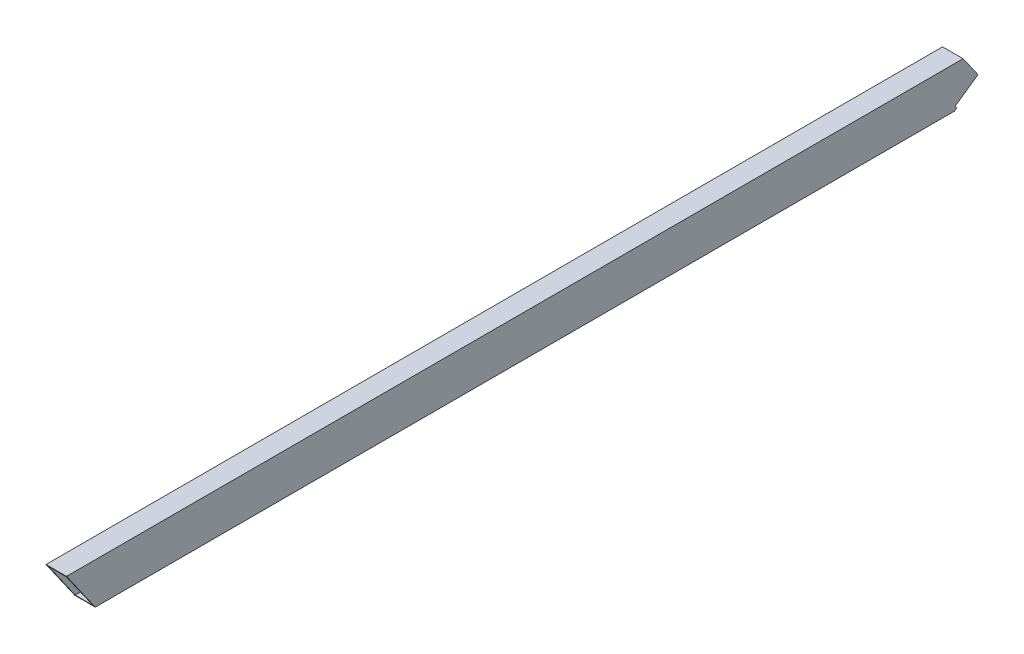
ISO-10303-21;
HEADER;
FILE_DESCRIPTION(('STEP AP214'),'2;1');
FILE_NAME('part.step','',(''),(''),'','','');
FILE_SCHEMA(('AUTOMOTIVE_DESIGN { 1 0 10303 214 1 1 1 1 }'));
ENDSEC;
DATA;
#1=APPLICATION_CONTEXT('core data for automotive mechanical design processes');
#2=APPLICATION_PROTOCOL_DEFINITION('international standard','automotive_design',2000,#1);
#3=PRODUCT_CONTEXT('',#1,'mechanical');
#4=PRODUCT('Part','Part','',(#3));
#5=PRODUCT_RELATED_PRODUCT_CATEGORY('part','',(#4));
#6=PRODUCT_DEFINITION_FORMATION('','',#4);
#7=PRODUCT_DEFINITION_CONTEXT('part definition',#1,'design');
#8=PRODUCT_DEFINITION('design','',#6,#7);
#9=PRODUCT_DEFINITION_SHAPE('','',#8);
#10=(LENGTH_UNIT() NAMED_UNIT(*) SI_UNIT(.MILLI.,.METRE.));
#11=(NAMED_UNIT(*) PLANE_ANGLE_UNIT() SI_UNIT($,.RADIAN.));
#12=(NAMED_UNIT(*) SI_UNIT($,.STERADIAN.) SOLID_ANGLE_UNIT());
#13=UNCERTAINTY_MEASURE_WITH_UNIT(LENGTH_MEASURE(1.E-05),#10,'distance_accuracy_value','');
#14=(GEOMETRIC_REPRESENTATION_CONTEXT(3) GLOBAL_UNCERTAINTY_ASSIGNED_CONTEXT((#13)) GLOBAL_UNIT_ASSIGNED_CONTEXT((#10,
#11,#12)) REPRESENTATION_CONTEXT('',''));
#15=CARTESIAN_POINT('',(0.,0.,0.));
#16=DIRECTION('',(0.,0.,1.));
#17=DIRECTION('',(1.,0.,0.));
#18=AXIS2_PLACEMENT_3D('',#15,#16,#17);
#19=CARTESIAN_POINT('',(-102.0000001,56.035463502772,-85.2820429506));
#20=DIRECTION('',(0.,0.819231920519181,0.573462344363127));
#21=DIRECTION('',(1.,0.,0.));
#22=AXIS2_PLACEMENT_3D('',#19,#20,#21);
#23=PLANE('',#22);
#24=DIRECTION('',(-1.,0.,0.));
#25=VECTOR('',#24,1.);
#26=CARTESIAN_POINT('',(-51.00000005,-2.457695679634,-1.720386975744));
#27=LINE('',#26,#25);
#28=CARTESIAN_POINT('',(-32.5,-2.457695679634,-1.720386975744));
#29=VERTEX_POINT('',#28);
#30=CARTESIAN_POINT('',(-37.5,-2.457695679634,-1.720386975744));
#31=VERTEX_POINT('',#30);
#32=EDGE_CURVE('E19',#29,#31,#27,.T.);
#33=ORIENTED_EDGE('',*,*,#32,.F.);
#34=DIRECTION('',(0.,-0.573462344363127,0.819231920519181));
#35=VECTOR('',#34,1.);
#36=CARTESIAN_POINT('',(-32.5,54.741904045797,-83.43410086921));
#37=LINE('',#36,#35);
#38=CARTESIAN_POINT('',(-32.5,-60.95085486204,81.841268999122));
#39=VERTEX_POINT('',#38);
#40=EDGE_CURVE('E223',#29,#39,#37,.T.);
#41=ORIENTED_EDGE('',*,*,#40,.T.);
#42=DIRECTION('',(1.,0.,0.));
#43=VECTOR('',#42,1.);
#44=CARTESIAN_POINT('',(-102.0000001,-60.95085486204,81.841268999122));
#45=LINE('',#44,#43);
#46=CARTESIAN_POINT('',(-37.5,-60.95085486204,81.841268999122));
#47=VERTEX_POINT('',#46);
#48=EDGE_CURVE('E277',#47,#39,#45,.T.);
#49=ORIENTED_EDGE('',*,*,#48,.F.);
#50=DIRECTION('',(0.,-0.573462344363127,0.819231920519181));
#51=VECTOR('',#50,1.);
#52=CARTESIAN_POINT('',(-37.5,55.564051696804,-84.60859751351));
#53=LINE('',#52,#51);
#54=EDGE_CURVE('E261',#31,#47,#53,.T.);
#55=ORIENTED_EDGE('',*,*,#54,.F.);
#56=EDGE_LOOP('',(#33,#41,#49,#55));
#57=FACE_BOUND('',#56,.T.);
#58=ADVANCED_FACE('F16',(#57),#23,.F.);
#59=CARTESIAN_POINT('',(32.5,70.,-70.));
#60=DIRECTION('',(0.,-1.,0.));
#61=DIRECTION('',(0.,0.,-1.));
#62=AXIS2_PLACEMENT_3D('',#59,#60,#61);
#63=PLANE('',#62);
#64=DIRECTION('',(-1.,0.,0.));
#65=VECTOR('',#64,1.);
#66=CARTESIAN_POINT('',(16.25,70.,49.));
#67=LINE('',#66,#65);
#68=CARTESIAN_POINT('',(32.5,70.,49.));
#69=VERTEX_POINT('',#68);
#70=CARTESIAN_POINT('',(-32.5,70.,49.));
#71=VERTEX_POINT('',#70);
#72=EDGE_CURVE('E47',#69,#71,#67,.T.);
#73=ORIENTED_EDGE('',*,*,#72,.F.);
#74=DIRECTION('',(0.,0.,1.));
#75=VECTOR('',#74,1.);
#76=CARTESIAN_POINT('',(32.5,70.,-70.));
#77=LINE('',#76,#75);
#78=CARTESIAN_POINT('',(32.5,70.,3322.79821614));
#79=VERTEX_POINT('',#78);
#80=EDGE_CURVE('E274',#69,#79,#77,.T.);
#81=ORIENTED_EDGE('',*,*,#80,.T.);
#82=DIRECTION('',(1.,0.,0.));
#83=VECTOR('',#82,1.);
#84=CARTESIAN_POINT('',(16.25,70.,3322.79821614));
#85=LINE('',#84,#83);
#86=CARTESIAN_POINT('',(-32.5,70.,3322.79821614));
#87=VERTEX_POINT('',#86);
#88=EDGE_CURVE('E244',#87,#79,#85,.T.);
#89=ORIENTED_EDGE('',*,*,#88,.F.);
#90=DIRECTION('',(0.,0.,1.));
#91=VECTOR('',#90,1.);
#92=CARTESIAN_POINT('',(-32.5,70.,-70.));
#93=LINE('',#92,#91);
#94=EDGE_CURVE('E234',#71,#87,#93,.T.);
#95=ORIENTED_EDGE('',*,*,#94,.F.);
#96=EDGE_LOOP('',(#73,#81,#89,#95));
#97=FACE_BOUND('',#96,.T.);
#98=ADVANCED_FACE('F359',(#97),#63,.T.);
#99=CARTESIAN_POINT('',(-102.0000001,56.035463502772,-85.2820429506));
#100=DIRECTION('',(0.,0.819231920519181,0.573462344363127));
#101=DIRECTION('',(1.,0.,0.));
#102=AXIS2_PLACEMENT_3D('',#99,#100,#101);
#103=PLANE('',#102);
#104=DIRECTION('',(0.,0.573462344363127,-0.819231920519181));
#105=VECTOR('',#104,1.);
#106=CARTESIAN_POINT('',(32.5,31.721769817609,-50.54819482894));
#107=LINE('',#106,#105);
#108=CARTESIAN_POINT('',(32.5,-60.95085486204,81.841268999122));
#109=VERTEX_POINT('',#108);
#110=CARTESIAN_POINT('',(32.5,-2.457695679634,-1.720386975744));
#111=VERTEX_POINT('',#110);
#112=EDGE_CURVE('E293',#109,#111,#107,.T.);
#113=ORIENTED_EDGE('',*,*,#112,.T.);
#114=DIRECTION('',(-1.,0.,0.));
#115=VECTOR('',#114,1.);
#116=CARTESIAN_POINT('',(-51.00000005,-2.457695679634,-1.720386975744));
#117=LINE('',#116,#115);
#118=CARTESIAN_POINT('',(37.5,-2.457695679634,-1.720386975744));
#119=VERTEX_POINT('',#118);
#120=EDGE_CURVE('E273',#119,#111,#117,.T.);
#121=ORIENTED_EDGE('',*,*,#120,.F.);
#122=DIRECTION('',(0.,0.573462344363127,-0.819231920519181));
#123=VECTOR('',#122,1.);
#124=CARTESIAN_POINT('',(37.5,30.899622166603,-49.37369818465));
#125=LINE('',#124,#123);
#126=CARTESIAN_POINT('',(37.5,-60.95085486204,81.841268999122));
#127=VERTEX_POINT('',#126);
#128=EDGE_CURVE('E220',#127,#119,#125,.T.);
#129=ORIENTED_EDGE('',*,*,#128,.F.);
#130=DIRECTION('',(1.,0.,0.));
#131=VECTOR('',#130,1.);
#132=CARTESIAN_POINT('',(-102.0000001,-60.95085486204,81.841268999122));
#133=LINE('',#132,#131);
#134=EDGE_CURVE('E37',#109,#127,#133,.T.);
#135=ORIENTED_EDGE('',*,*,#134,.F.);
#136=EDGE_LOOP('',(#113,#121,#129,#135));
#137=FACE_BOUND('',#136,.T.);
#138=ADVANCED_FACE('F341',(#137),#103,.F.);
#139=CARTESIAN_POINT('',(37.5,75.,-70.));
#140=DIRECTION('',(0.,-1.,0.));
#141=DIRECTION('',(0.,0.,-1.));
#142=AXIS2_PLACEMENT_3D('',#139,#140,#141);
#143=PLANE('',#142);
#144=DIRECTION('',(0.,0.,1.));
#145=VECTOR('',#144,1.);
#146=CARTESIAN_POINT('',(-37.5,75.,-70.));
#147=LINE('',#146,#145);
#148=CARTESIAN_POINT('',(-37.5,75.,52.5));
#149=VERTEX_POINT('',#148);
#150=CARTESIAN_POINT('',(-37.5,75.,3326.29821614));
#151=VERTEX_POINT('',#150);
#152=EDGE_CURVE('E195',#149,#151,#147,.T.);
#153=ORIENTED_EDGE('',*,*,#152,.T.);
#154=DIRECTION('',(1.,0.,0.));
#155=VECTOR('',#154,1.);
#156=CARTESIAN_POINT('',(18.75,75.,3326.29821614));
#157=LINE('',#156,#155);
#158=CARTESIAN_POINT('',(37.5,75.,3326.29821614));
#159=VERTEX_POINT('',#158);
#160=EDGE_CURVE('E238',#151,#159,#157,.T.);
#161=ORIENTED_EDGE('',*,*,#160,.T.);
#162=DIRECTION('',(0.,0.,1.));
#163=VECTOR('',#162,1.);
#164=CARTESIAN_POINT('',(37.5,75.,-70.));
#165=LINE('',#164,#163);
#166=CARTESIAN_POINT('',(37.5,75.,52.5));
#167=VERTEX_POINT('',#166);
#168=EDGE_CURVE('E214',#167,#159,#165,.T.);
#169=ORIENTED_EDGE('',*,*,#168,.F.);
#170=DIRECTION('',(-1.,0.,0.));
#171=VECTOR('',#170,1.);
#172=CARTESIAN_POINT('',(18.75,75.,52.5));
#173=LINE('',#172,#171);
#174=EDGE_CURVE('E10',#167,#149,#173,.T.);
#175=ORIENTED_EDGE('',*,*,#174,.T.);
#176=EDGE_LOOP('',(#153,#161,#169,#175));
#177=FACE_BOUND('',#176,.T.);
#178=ADVANCED_FACE('F343',(#177),#143,.F.);
#179=CARTESIAN_POINT('',(0.,0.,0.));
#180=DIRECTION('',(0.,-0.573462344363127,0.819231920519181));
#181=DIRECTION('',(-1.,0.,0.));
#182=AXIS2_PLACEMENT_3D('',#179,#180,#181);
#183=PLANE('',#182);
#184=ORIENTED_EDGE('',*,*,#120,.T.);
#185=DIRECTION('',(0.,0.819231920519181,0.573462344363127));
#186=VECTOR('',#185,1.);
#187=CARTESIAN_POINT('',(32.5,-39.93288590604,-27.95302013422));
#188=LINE('',#187,#186);
#189=EDGE_CURVE('E289',#111,#69,#188,.T.);
#190=ORIENTED_EDGE('',*,*,#189,.T.);
#191=ORIENTED_EDGE('',*,*,#72,.T.);
#192=DIRECTION('',(0.,-0.819231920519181,-0.573462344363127));
#193=VECTOR('',#192,1.);
#194=CARTESIAN_POINT('',(-32.5,7.046979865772,4.93288590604));
#195=LINE('',#194,#193);
#196=EDGE_CURVE('E281',#71,#29,#195,.T.);
#197=ORIENTED_EDGE('',*,*,#196,.T.);
#198=ORIENTED_EDGE('',*,*,#32,.T.);
#199=DIRECTION('',(0.,-0.819231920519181,-0.573462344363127));
#200=VECTOR('',#199,1.);
#201=CARTESIAN_POINT('',(-37.5,8.724832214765,6.107382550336));
#202=LINE('',#201,#200);
#203=EDGE_CURVE('E196',#149,#31,#202,.T.);
#204=ORIENTED_EDGE('',*,*,#203,.F.);
#205=ORIENTED_EDGE('',*,*,#174,.F.);
#206=DIRECTION('',(0.,0.819231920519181,0.573462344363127));
#207=VECTOR('',#206,1.);
#208=CARTESIAN_POINT('',(37.5,-41.61073825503,-29.12751677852));
#209=LINE('',#208,#207);
#210=EDGE_CURVE('E231',#119,#167,#209,.T.);
#211=ORIENTED_EDGE('',*,*,#210,.F.);
#212=EDGE_LOOP('',(#184,#190,#191,#197,#198,#204,#205,#211));
#213=FACE_BOUND('',#212,.T.);
#214=ADVANCED_FACE('F309',(#213),#183,.F.);
#215=CARTESIAN_POINT('',(-102.0000001,-80.61242111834,68.078172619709));
#216=DIRECTION('',(0.,-0.573462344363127,0.819231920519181));
#217=DIRECTION('',(-1.,0.,0.));
#218=AXIS2_PLACEMENT_3D('',#215,#216,#217);
#219=PLANE('',#218);
#220=DIRECTION('',(0.,0.819231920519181,0.573462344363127));
#221=VECTOR('',#220,1.);
#222=CARTESIAN_POINT('',(37.5,-111.1635284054,46.692397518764));
#223=LINE('',#222,#221);
#224=CARTESIAN_POINT('',(37.5,-69.14317414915,76.106645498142));
#225=VERTEX_POINT('',#224);
#226=EDGE_CURVE('E217',#225,#127,#223,.T.);
#227=ORIENTED_EDGE('',*,*,#226,.F.);
#228=DIRECTION('',(1.,0.,0.));
#229=VECTOR('',#228,1.);
#230=CARTESIAN_POINT('',(-51.00000005,-69.14317414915,76.106645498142));
#231=LINE('',#230,#229);
#232=CARTESIAN_POINT('',(32.5,-69.14317414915,76.106645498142));
#233=VERTEX_POINT('',#232);
#234=EDGE_CURVE('E162',#233,#225,#231,.T.);
#235=ORIENTED_EDGE('',*,*,#234,.F.);
#236=DIRECTION('',(0.,0.819231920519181,0.573462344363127));
#237=VECTOR('',#236,1.);
#238=CARTESIAN_POINT('',(32.5,-109.4856760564,47.866894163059));
#239=LINE('',#238,#237);
#240=EDGE_CURVE('E296',#233,#109,#239,.T.);
#241=ORIENTED_EDGE('',*,*,#240,.T.);
#242=ORIENTED_EDGE('',*,*,#134,.T.);
#243=EDGE_LOOP('',(#227,#235,#241,#242));
#244=FACE_BOUND('',#243,.T.);
#245=ADVANCED_FACE('F338',(#244),#219,.F.);
#246=CARTESIAN_POINT('',(32.5,-70.,-70.));
#247=DIRECTION('',(-1.,0.,0.));
#248=DIRECTION('',(0.,0.,1.));
#249=AXIS2_PLACEMENT_3D('',#246,#247,#248);
#250=PLANE('',#249);
#251=ORIENTED_EDGE('',*,*,#189,.F.);
#252=ORIENTED_EDGE('',*,*,#112,.F.);
#253=ORIENTED_EDGE('',*,*,#240,.F.);
#254=DIRECTION('',(0.,0.573462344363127,-0.819231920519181));
#255=VECTOR('',#254,1.);
#256=CARTESIAN_POINT('',(32.5,-5.717129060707,-14.50199034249));
#257=LINE('',#256,#255);
#258=CARTESIAN_POINT('',(32.5,-70.,77.330682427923));
#259=VERTEX_POINT('',#258);
#260=EDGE_CURVE('E207',#259,#233,#257,.T.);
#261=ORIENTED_EDGE('',*,*,#260,.F.);
#262=DIRECTION('',(0.,0.,1.));
#263=VECTOR('',#262,1.);
#264=CARTESIAN_POINT('',(32.5,-70.,-70.));
#265=LINE('',#264,#263);
#266=CARTESIAN_POINT('',(32.5,-70.,3224.79821614));
#267=VERTEX_POINT('',#266);
#268=EDGE_CURVE('E226',#259,#267,#265,.T.);
#269=ORIENTED_EDGE('',*,*,#268,.T.);
#270=DIRECTION('',(0.,-0.819231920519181,-0.573462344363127));
#271=VECTOR('',#270,1.);
#272=CARTESIAN_POINT('',(32.5,-1577.958893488,2169.226990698));
#273=LINE('',#272,#271);
#274=EDGE_CURVE('E249',#79,#267,#273,.T.);
#275=ORIENTED_EDGE('',*,*,#274,.F.);
#276=ORIENTED_EDGE('',*,*,#80,.F.);
#277=EDGE_LOOP('',(#251,#252,#253,#261,#269,#275,#276));
#278=FACE_BOUND('',#277,.T.);
#279=ADVANCED_FACE('F334',(#278),#250,.T.);
#280=CARTESIAN_POINT('',(-32.5,-70.,-70.));
#281=DIRECTION('',(0.,1.,0.));
#282=DIRECTION('',(1.,0.,0.));
#283=AXIS2_PLACEMENT_3D('',#280,#281,#282);
#284=PLANE('',#283);
#285=DIRECTION('',(1.,0.,0.));
#286=VECTOR('',#285,1.);
#287=CARTESIAN_POINT('',(-16.25,-70.,77.330682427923));
#288=LINE('',#287,#286);
#289=CARTESIAN_POINT('',(-32.5,-70.,77.330682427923));
#290=VERTEX_POINT('',#289);
#291=EDGE_CURVE('E203',#290,#259,#288,.T.);
#292=ORIENTED_EDGE('',*,*,#291,.F.);
#293=DIRECTION('',(0.,0.,1.));
#294=VECTOR('',#293,1.);
#295=CARTESIAN_POINT('',(-32.5,-70.,-70.));
#296=LINE('',#295,#294);
#297=CARTESIAN_POINT('',(-32.5,-70.,3224.79821614));
#298=VERTEX_POINT('',#297);
#299=EDGE_CURVE('E227',#290,#298,#296,.T.);
#300=ORIENTED_EDGE('',*,*,#299,.T.);
#301=DIRECTION('',(-1.,0.,0.));
#302=VECTOR('',#301,1.);
#303=CARTESIAN_POINT('',(-16.25,-70.,3224.79821614));
#304=LINE('',#303,#302);
#305=EDGE_CURVE('E253',#267,#298,#304,.T.);
#306=ORIENTED_EDGE('',*,*,#305,.F.);
#307=ORIENTED_EDGE('',*,*,#268,.F.);
#308=EDGE_LOOP('',(#292,#300,#306,#307));
#309=FACE_BOUND('',#308,.T.);
#310=ADVANCED_FACE('F330',(#309),#284,.T.);
#311=CARTESIAN_POINT('',(-32.5,70.,-70.));
#312=DIRECTION('',(1.,0.,0.));
#313=DIRECTION('',(0.,1.,0.));
#314=AXIS2_PLACEMENT_3D('',#311,#312,#313);
#315=PLANE('',#314);
#316=ORIENTED_EDGE('',*,*,#196,.F.);
#317=ORIENTED_EDGE('',*,*,#94,.T.);
#318=DIRECTION('',(0.,0.819231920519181,0.573462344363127));
#319=VECTOR('',#318,1.);
#320=CARTESIAN_POINT('',(-32.5,-1530.979027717,2202.112896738));
#321=LINE('',#320,#319);
#322=EDGE_CURVE('E257',#298,#87,#321,.T.);
#323=ORIENTED_EDGE('',*,*,#322,.F.);
#324=ORIENTED_EDGE('',*,*,#299,.F.);
#325=DIRECTION('',(0.,-0.573462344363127,0.819231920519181));
#326=VECTOR('',#325,1.);
#327=CARTESIAN_POINT('',(-32.5,17.303005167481,-47.38789638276));
#328=LINE('',#327,#326);
#329=CARTESIAN_POINT('',(-32.5,-69.14317414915,76.106645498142));
#330=VERTEX_POINT('',#329);
#331=EDGE_CURVE('E177',#330,#290,#328,.T.);
#332=ORIENTED_EDGE('',*,*,#331,.F.);
#333=DIRECTION('',(0.,-0.819231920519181,-0.573462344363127));
#334=VECTOR('',#333,1.);
#335=CARTESIAN_POINT('',(-32.5,-62.5058102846,80.752800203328));
#336=LINE('',#335,#334);
#337=EDGE_CURVE('E270',#39,#330,#336,.T.);
#338=ORIENTED_EDGE('',*,*,#337,.F.);
#339=ORIENTED_EDGE('',*,*,#40,.F.);
#340=EDGE_LOOP('',(#316,#317,#323,#324,#332,#338,#339));
#341=FACE_BOUND('',#340,.T.);
#342=ADVANCED_FACE('F325',(#341),#315,.T.);
#343=CARTESIAN_POINT('',(-102.0000001,-80.61242111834,68.078172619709));
#344=DIRECTION('',(0.,-0.573462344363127,0.819231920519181));
#345=DIRECTION('',(-1.,0.,0.));
#346=AXIS2_PLACEMENT_3D('',#343,#344,#345);
#347=PLANE('',#346);
#348=ORIENTED_EDGE('',*,*,#337,.T.);
#349=DIRECTION('',(1.,0.,0.));
#350=VECTOR('',#349,1.);
#351=CARTESIAN_POINT('',(-51.00000005,-69.14317414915,76.106645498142));
#352=LINE('',#351,#350);
#353=CARTESIAN_POINT('',(-37.5,-69.14317414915,76.106645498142));
#354=VERTEX_POINT('',#353);
#355=EDGE_CURVE('E194',#354,#330,#352,.T.);
#356=ORIENTED_EDGE('',*,*,#355,.F.);
#357=DIRECTION('',(0.,-0.819231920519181,-0.573462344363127));
#358=VECTOR('',#357,1.);
#359=CARTESIAN_POINT('',(-37.5,-60.8279579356,81.927296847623));
#360=LINE('',#359,#358);
#361=EDGE_CURVE('E197',#47,#354,#360,.T.);
#362=ORIENTED_EDGE('',*,*,#361,.F.);
#363=ORIENTED_EDGE('',*,*,#48,.T.);
#364=EDGE_LOOP('',(#348,#356,#362,#363));
#365=FACE_BOUND('',#364,.T.);
#366=ADVANCED_FACE('F321',(#365),#347,.F.);
#367=CARTESIAN_POINT('',(-37.5,75.,-70.));
#368=DIRECTION('',(1.,0.,0.));
#369=DIRECTION('',(0.,1.,0.));
#370=AXIS2_PLACEMENT_3D('',#367,#368,#369);
#371=PLANE('',#370);
#372=ORIENTED_EDGE('',*,*,#54,.T.);
#373=ORIENTED_EDGE('',*,*,#361,.T.);
#374=DIRECTION('',(0.,-0.573462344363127,0.819231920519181));
#375=VECTOR('',#374,1.);
#376=CARTESIAN_POINT('',(-37.5,18.125152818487,-48.56239302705));
#377=LINE('',#376,#375);
#378=CARTESIAN_POINT('',(-37.5,-75.,84.47353957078));
#379=VERTEX_POINT('',#378);
#380=EDGE_CURVE('E167',#354,#379,#377,.T.);
#381=ORIENTED_EDGE('',*,*,#380,.T.);
#382=DIRECTION('',(0.,0.,1.));
#383=VECTOR('',#382,1.);
#384=CARTESIAN_POINT('',(-37.5,-75.,-70.));
#385=LINE('',#384,#383);
#386=CARTESIAN_POINT('',(-37.5,-75.,3221.29821614));
#387=VERTEX_POINT('',#386);
#388=EDGE_CURVE('E175',#379,#387,#385,.T.);
#389=ORIENTED_EDGE('',*,*,#388,.T.);
#390=DIRECTION('',(0.,0.819231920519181,0.573462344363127));
#391=VECTOR('',#390,1.);
#392=CARTESIAN_POINT('',(-37.5,-1529.301175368,2203.287393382));
#393=LINE('',#392,#391);
#394=EDGE_CURVE('E241',#387,#151,#393,.T.);
#395=ORIENTED_EDGE('',*,*,#394,.T.);
#396=ORIENTED_EDGE('',*,*,#152,.F.);
#397=ORIENTED_EDGE('',*,*,#203,.T.);
#398=EDGE_LOOP('',(#372,#373,#381,#389,#395,#396,#397));
#399=FACE_BOUND('',#398,.T.);
#400=ADVANCED_FACE('F316',(#399),#371,.F.);
#401=CARTESIAN_POINT('',(0.,-1538.026007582,2197.180010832));
#402=DIRECTION('',(0.,0.573462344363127,-0.819231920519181));
#403=DIRECTION('',(-1.,0.,0.));
#404=AXIS2_PLACEMENT_3D('',#401,#402,#403);
#405=PLANE('',#404);
#406=ORIENTED_EDGE('',*,*,#88,.T.);
#407=ORIENTED_EDGE('',*,*,#274,.T.);
#408=ORIENTED_EDGE('',*,*,#305,.T.);
#409=ORIENTED_EDGE('',*,*,#322,.T.);
#410=EDGE_LOOP('',(#406,#407,#408,#409));
#411=FACE_BOUND('',#410,.T.);
#412=ORIENTED_EDGE('',*,*,#160,.F.);
#413=ORIENTED_EDGE('',*,*,#394,.F.);
#414=DIRECTION('',(-1.,0.,0.));
#415=VECTOR('',#414,1.);
#416=CARTESIAN_POINT('',(-18.75,-75.,3221.29821614));
#417=LINE('',#416,#415);
#418=CARTESIAN_POINT('',(37.5,-75.,3221.29821614));
#419=VERTEX_POINT('',#418);
#420=EDGE_CURVE('E185',#419,#387,#417,.T.);
#421=ORIENTED_EDGE('',*,*,#420,.F.);
#422=DIRECTION('',(0.,-0.819231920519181,-0.573462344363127));
#423=VECTOR('',#422,1.);
#424=CARTESIAN_POINT('',(37.5,-1579.636745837,2168.052494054));
#425=LINE('',#424,#423);
#426=EDGE_CURVE('E182',#159,#419,#425,.T.);
#427=ORIENTED_EDGE('',*,*,#426,.F.);
#428=EDGE_LOOP('',(#412,#413,#421,#427));
#429=FACE_BOUND('',#428,.T.);
#430=ADVANCED_FACE('F346',(#411,#429),#405,.F.);
#431=CARTESIAN_POINT('',(37.5,-75.,-70.));
#432=DIRECTION('',(-1.,0.,0.));
#433=DIRECTION('',(0.,0.,1.));
#434=AXIS2_PLACEMENT_3D('',#431,#432,#433);
#435=PLANE('',#434);
#436=ORIENTED_EDGE('',*,*,#168,.T.);
#437=ORIENTED_EDGE('',*,*,#426,.T.);
#438=DIRECTION('',(0.,0.,1.));
#439=VECTOR('',#438,1.);
#440=CARTESIAN_POINT('',(37.5,-75.,-70.));
#441=LINE('',#440,#439);
#442=CARTESIAN_POINT('',(37.5,-75.,84.47353957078));
#443=VERTEX_POINT('',#442);
#444=EDGE_CURVE('E173',#443,#419,#441,.T.);
#445=ORIENTED_EDGE('',*,*,#444,.F.);
#446=DIRECTION('',(0.,0.573462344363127,-0.819231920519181));
#447=VECTOR('',#446,1.);
#448=CARTESIAN_POINT('',(37.5,-6.539276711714,-13.3274936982));
#449=LINE('',#448,#447);
#450=EDGE_CURVE('E153',#443,#225,#449,.T.);
#451=ORIENTED_EDGE('',*,*,#450,.T.);
#452=ORIENTED_EDGE('',*,*,#226,.T.);
#453=ORIENTED_EDGE('',*,*,#128,.T.);
#454=ORIENTED_EDGE('',*,*,#210,.T.);
#455=EDGE_LOOP('',(#436,#437,#445,#451,#452,#453,#454));
#456=FACE_BOUND('',#455,.T.);
#457=ADVANCED_FACE('F180',(#456),#435,.F.);
#458=CARTESIAN_POINT('',(0.,-10.65001496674,-7.455010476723));
#459=DIRECTION('',(0.,0.819231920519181,0.573462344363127));
#460=DIRECTION('',(1.,0.,0.));
#461=AXIS2_PLACEMENT_3D('',#458,#459,#460);
#462=PLANE('',#461);
#463=ORIENTED_EDGE('',*,*,#331,.T.);
#464=ORIENTED_EDGE('',*,*,#291,.T.);
#465=ORIENTED_EDGE('',*,*,#260,.T.);
#466=ORIENTED_EDGE('',*,*,#234,.T.);
#467=ORIENTED_EDGE('',*,*,#450,.F.);
#468=DIRECTION('',(1.,0.,0.));
#469=VECTOR('',#468,1.);
#470=CARTESIAN_POINT('',(-18.75,-75.,84.47353957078));
#471=LINE('',#470,#469);
#472=EDGE_CURVE('E158',#379,#443,#471,.T.);
#473=ORIENTED_EDGE('',*,*,#472,.F.);
#474=ORIENTED_EDGE('',*,*,#380,.F.);
#475=ORIENTED_EDGE('',*,*,#355,.T.);
#476=EDGE_LOOP('',(#463,#464,#465,#466,#467,#473,#474,#475));
#477=FACE_BOUND('',#476,.T.);
#478=ADVANCED_FACE('F156',(#477),#462,.F.);
#479=CARTESIAN_POINT('',(-37.5,-75.,-70.));
#480=DIRECTION('',(0.,1.,0.));
#481=DIRECTION('',(1.,0.,0.));
#482=AXIS2_PLACEMENT_3D('',#479,#480,#481);
#483=PLANE('',#482);
#484=ORIENTED_EDGE('',*,*,#444,.T.);
#485=ORIENTED_EDGE('',*,*,#420,.T.);
#486=ORIENTED_EDGE('',*,*,#388,.F.);
#487=ORIENTED_EDGE('',*,*,#472,.T.);
#488=EDGE_LOOP('',(#484,#485,#486,#487));
#489=FACE_BOUND('',#488,.T.);
#490=ADVANCED_FACE('F171',(#489),#483,.F.);
#491=CLOSED_SHELL('',(#58,#98,#138,#178,#214,#245,#279,#310,#342,#366,#400,#430,#457,#478,#490));
#492=MANIFOLD_SOLID_BREP('B1',#491);
#493=ADVANCED_BREP_SHAPE_REPRESENTATION('',(#18,#492),#14);
#494=SHAPE_DEFINITION_REPRESENTATION(#9,#493);
ENDSEC;
END-ISO-10303-21;
